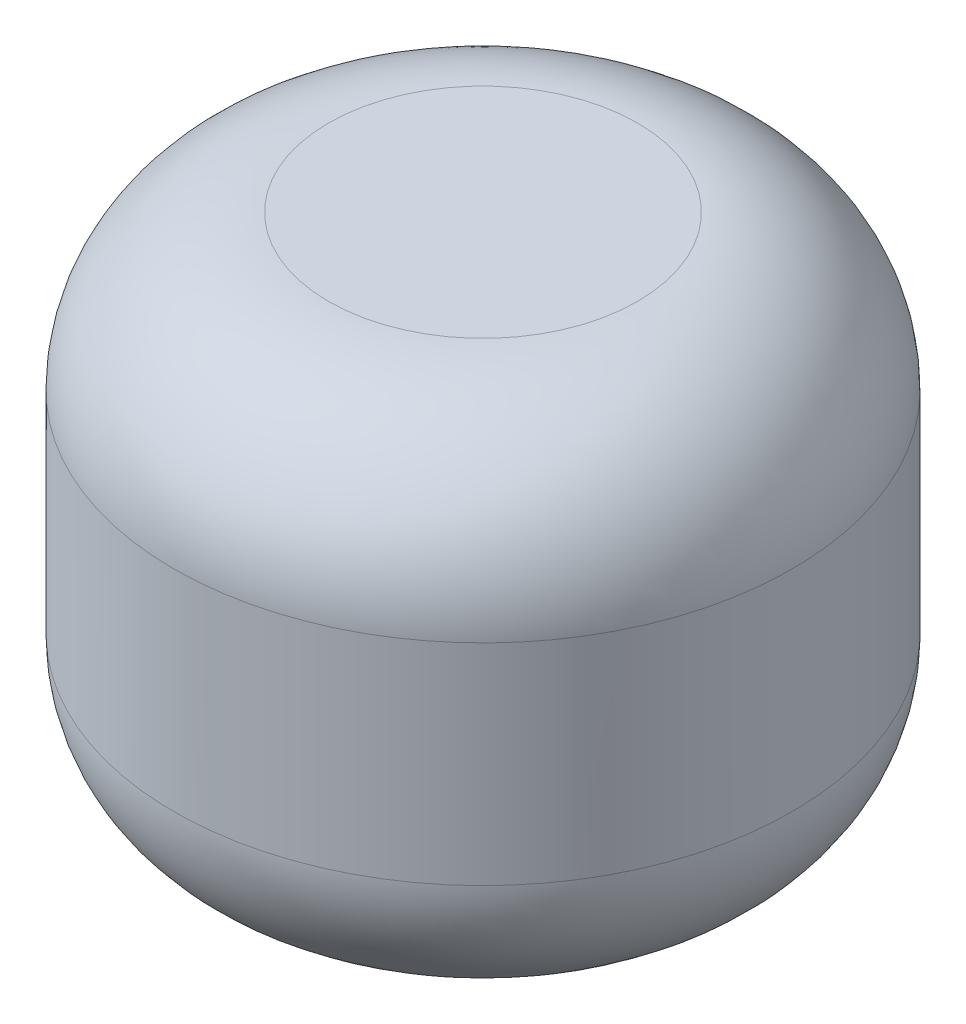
ISO-10303-21;
HEADER;
FILE_DESCRIPTION(('STEP AP214'),'2;1');
FILE_NAME('part.step','',(''),(''),'','','');
FILE_SCHEMA(('AUTOMOTIVE_DESIGN { 1 0 10303 214 1 1 1 1 }'));
ENDSEC;
DATA;
#1=APPLICATION_CONTEXT('core data for automotive mechanical design processes');
#2=APPLICATION_PROTOCOL_DEFINITION('international standard','automotive_design',2000,#1);
#3=PRODUCT_CONTEXT('',#1,'mechanical');
#4=PRODUCT('Part','Part','',(#3));
#5=PRODUCT_RELATED_PRODUCT_CATEGORY('part','',(#4));
#6=PRODUCT_DEFINITION_FORMATION('','',#4);
#7=PRODUCT_DEFINITION_CONTEXT('part definition',#1,'design');
#8=PRODUCT_DEFINITION('design','',#6,#7);
#9=PRODUCT_DEFINITION_SHAPE('','',#8);
#10=(LENGTH_UNIT() NAMED_UNIT(*) SI_UNIT(.MILLI.,.METRE.));
#11=(NAMED_UNIT(*) PLANE_ANGLE_UNIT() SI_UNIT($,.RADIAN.));
#12=(NAMED_UNIT(*) SI_UNIT($,.STERADIAN.) SOLID_ANGLE_UNIT());
#13=UNCERTAINTY_MEASURE_WITH_UNIT(LENGTH_MEASURE(1.E-05),#10,'distance_accuracy_value','');
#14=(GEOMETRIC_REPRESENTATION_CONTEXT(3) GLOBAL_UNCERTAINTY_ASSIGNED_CONTEXT((#13)) GLOBAL_UNIT_ASSIGNED_CONTEXT((#10,
#11,#12)) REPRESENTATION_CONTEXT('',''));
#15=CARTESIAN_POINT('',(0.,0.,0.));
#16=DIRECTION('',(0.,0.,1.));
#17=DIRECTION('',(1.,0.,0.));
#18=AXIS2_PLACEMENT_3D('',#15,#16,#17);
#19=CARTESIAN_POINT('',(0.,5.,0.));
#20=DIRECTION('',(0.,-1.,0.));
#21=DIRECTION('',(0.,0.,-1.));
#22=AXIS2_PLACEMENT_3D('',#19,#20,#21);
#23=CYLINDRICAL_SURFACE('',#22,6.);
#24=CARTESIAN_POINT('',(0.,-2.0811950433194,0.));
#25=DIRECTION('',(0.,-1.,0.));
#26=DIRECTION('',(0.,0.,-1.));
#27=AXIS2_PLACEMENT_3D('',#24,#25,#26);
#28=CIRCLE('',#27,6.);
#29=CARTESIAN_POINT('',(0.,-2.0811950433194,-6.));
#30=VERTEX_POINT('',#29);
#31=EDGE_CURVE('E39',#30,#30,#28,.F.);
#32=ORIENTED_EDGE('',*,*,#31,.T.);
#33=EDGE_LOOP('',(#32));
#34=FACE_BOUND('',#33,.T.);
#35=CARTESIAN_POINT('',(0.,2.,0.));
#36=DIRECTION('',(0.,1.,0.));
#37=DIRECTION('',(0.,0.,1.));
#38=AXIS2_PLACEMENT_3D('',#35,#36,#37);
#39=CIRCLE('',#38,6.);
#40=CARTESIAN_POINT('',(0.,2.,6.));
#41=VERTEX_POINT('',#40);
#42=EDGE_CURVE('E43',#41,#41,#39,.F.);
#43=ORIENTED_EDGE('',*,*,#42,.T.);
#44=EDGE_LOOP('',(#43));
#45=FACE_BOUND('',#44,.T.);
#46=ADVANCED_FACE('F32',(#34,#45),#23,.T.);
#47=CARTESIAN_POINT('',(0.,5.,0.));
#48=DIRECTION('',(0.,1.,0.));
#49=DIRECTION('',(0.,0.,1.));
#50=AXIS2_PLACEMENT_3D('',#47,#48,#49);
#51=PLANE('',#50);
#52=CARTESIAN_POINT('',(0.,5.,0.));
#53=DIRECTION('',(0.,1.,0.));
#54=DIRECTION('',(0.,0.,1.));
#55=AXIS2_PLACEMENT_3D('',#52,#53,#54);
#56=CIRCLE('',#55,3.);
#57=CARTESIAN_POINT('',(0.,5.,3.));
#58=VERTEX_POINT('',#57);
#59=EDGE_CURVE('E10',#58,#58,#56,.T.);
#60=ORIENTED_EDGE('',*,*,#59,.T.);
#61=EDGE_LOOP('',(#60));
#62=FACE_BOUND('',#61,.T.);
#63=ADVANCED_FACE('F63',(#62),#51,.T.);
#64=CARTESIAN_POINT('',(0.,-3.,0.));
#65=DIRECTION('',(-1.,0.,0.));
#66=DIRECTION('',(0.,1.,0.));
#67=AXIS2_PLACEMENT_3D('',#64,#65,#66);
#68=SPHERICAL_SURFACE('',#67,4.2);
#69=CARTESIAN_POINT('',(0.,-3.,0.));
#70=DIRECTION('',(0.,1.,0.));
#71=DIRECTION('',(0.,0.,1.));
#72=AXIS2_PLACEMENT_3D('',#69,#70,#71);
#73=SPHERICAL_SURFACE('',#72,4.2);
#74=CARTESIAN_POINT('',(0.,-5.,0.));
#75=DIRECTION('',(0.,1.,0.));
#76=DIRECTION('',(0.,0.,1.));
#77=AXIS2_PLACEMENT_3D('',#74,#75,#76);
#78=CIRCLE('',#77,3.69323706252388);
#79=CARTESIAN_POINT('',(0.,-5.,3.69323706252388));
#80=VERTEX_POINT('',#79);
#81=EDGE_CURVE('E47',#80,#80,#78,.F.);
#82=ORIENTED_EDGE('',*,*,#81,.T.);
#83=EDGE_LOOP('',(#82));
#84=FACE_BOUND('',#83,.T.);
#85=ADVANCED_FACE('F53',(#84),#73,.F.);
#86=CARTESIAN_POINT('',(0.,-2.0811950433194,0.));
#87=DIRECTION('',(0.,-1.,0.));
#88=DIRECTION('',(0.,0.,-1.));
#89=AXIS2_PLACEMENT_3D('',#86,#87,#88);
#90=DEGENERATE_TOROIDAL_SURFACE('',#89,3.,3.,.T.);
#91=ORIENTED_EDGE('',*,*,#81,.F.);
#92=EDGE_LOOP('',(#91));
#93=FACE_BOUND('',#92,.T.);
#94=ORIENTED_EDGE('',*,*,#31,.F.);
#95=EDGE_LOOP('',(#94));
#96=FACE_BOUND('',#95,.T.);
#97=ADVANCED_FACE('F55',(#93,#96),#90,.T.);
#98=CARTESIAN_POINT('',(0.,2.,0.));
#99=DIRECTION('',(0.,1.,0.));
#100=DIRECTION('',(0.,0.,1.));
#101=AXIS2_PLACEMENT_3D('',#98,#99,#100);
#102=DEGENERATE_TOROIDAL_SURFACE('',#101,3.,3.,.T.);
#103=ORIENTED_EDGE('',*,*,#42,.F.);
#104=EDGE_LOOP('',(#103));
#105=FACE_BOUND('',#104,.T.);
#106=ORIENTED_EDGE('',*,*,#59,.F.);
#107=EDGE_LOOP('',(#106));
#108=FACE_BOUND('',#107,.T.);
#109=ADVANCED_FACE('F34',(#105,#108),#102,.T.);
#110=CLOSED_SHELL('',(#46,#63,#85,#97,#109));
#111=MANIFOLD_SOLID_BREP('B2',#110);
#112=ADVANCED_BREP_SHAPE_REPRESENTATION('',(#18,#111),#14);
#113=SHAPE_DEFINITION_REPRESENTATION(#9,#112);
ENDSEC;
END-ISO-10303-21;
